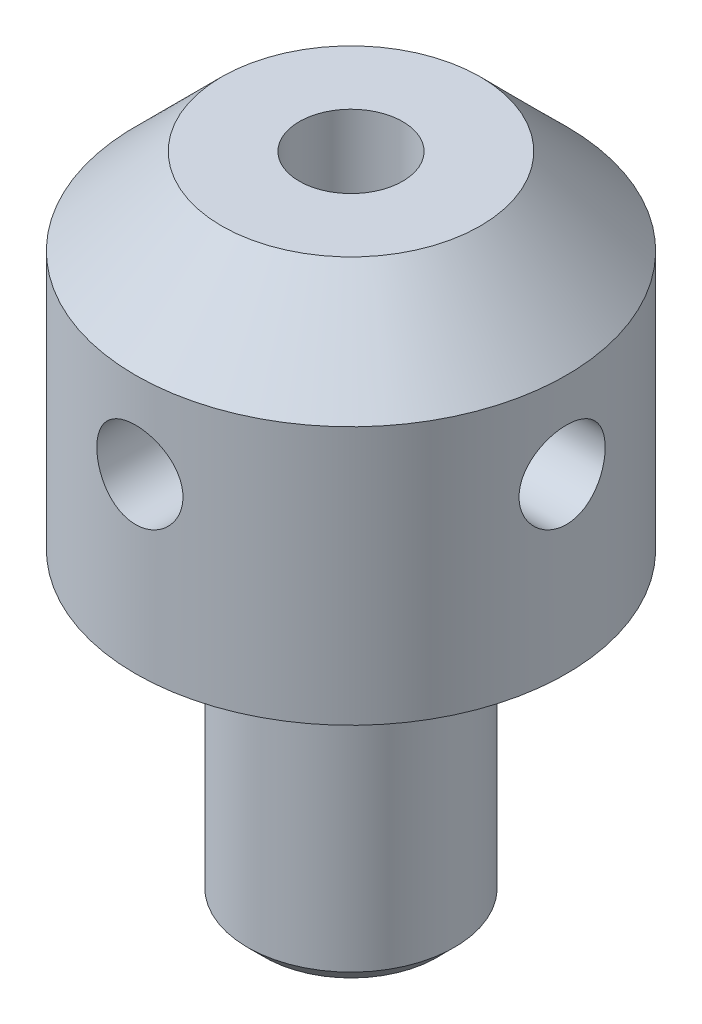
ISO-10303-21;
HEADER;
FILE_DESCRIPTION(('STEP AP214'),'2;1');
FILE_NAME('part.step','',(''),(''),'','','');
FILE_SCHEMA(('AUTOMOTIVE_DESIGN { 1 0 10303 214 1 1 1 1 }'));
ENDSEC;
DATA;
#1=APPLICATION_CONTEXT('core data for automotive mechanical design processes');
#2=APPLICATION_PROTOCOL_DEFINITION('international standard','automotive_design',2000,#1);
#3=PRODUCT_CONTEXT('',#1,'mechanical');
#4=PRODUCT('Part','Part','',(#3));
#5=PRODUCT_RELATED_PRODUCT_CATEGORY('part','',(#4));
#6=PRODUCT_DEFINITION_FORMATION('','',#4);
#7=PRODUCT_DEFINITION_CONTEXT('part definition',#1,'design');
#8=PRODUCT_DEFINITION('design','',#6,#7);
#9=PRODUCT_DEFINITION_SHAPE('','',#8);
#10=(LENGTH_UNIT() NAMED_UNIT(*) SI_UNIT(.MILLI.,.METRE.));
#11=(NAMED_UNIT(*) PLANE_ANGLE_UNIT() SI_UNIT($,.RADIAN.));
#12=(NAMED_UNIT(*) SI_UNIT($,.STERADIAN.) SOLID_ANGLE_UNIT());
#13=UNCERTAINTY_MEASURE_WITH_UNIT(LENGTH_MEASURE(1.E-05),#10,'distance_accuracy_value','');
#14=(GEOMETRIC_REPRESENTATION_CONTEXT(3) GLOBAL_UNCERTAINTY_ASSIGNED_CONTEXT((#13)) GLOBAL_UNIT_ASSIGNED_CONTEXT((#10,
#11,#12)) REPRESENTATION_CONTEXT('',''));
#15=CARTESIAN_POINT('',(0.,0.,0.));
#16=DIRECTION('',(0.,0.,1.));
#17=DIRECTION('',(1.,0.,0.));
#18=AXIS2_PLACEMENT_3D('',#15,#16,#17);
#19=CARTESIAN_POINT('',(0.,20.,0.));
#20=DIRECTION('',(0.,-1.,0.));
#21=DIRECTION('',(0.,0.,-1.));
#22=AXIS2_PLACEMENT_3D('',#19,#20,#21);
#23=CYLINDRICAL_SURFACE('',#22,12.5);
#24=CARTESIAN_POINT('',(0.,12.5,-12.5));
#25=CARTESIAN_POINT('',(0.138942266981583,12.4999948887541,-12.4999974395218));
#26=CARTESIAN_POINT('',(0.277949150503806,12.4883778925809,-12.4976596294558));
#27=CARTESIAN_POINT('',(0.552033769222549,12.4422537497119,-12.4885591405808));
#28=CARTESIAN_POINT('',(0.687108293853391,12.4077284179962,-12.4817929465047));
#29=CARTESIAN_POINT('',(0.949325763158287,12.3168968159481,-12.4645912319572));
#30=CARTESIAN_POINT('',(1.07647616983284,12.2606114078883,-12.454159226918));
#31=CARTESIAN_POINT('',(1.31951997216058,12.1279193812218,-12.4307599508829));
#32=CARTESIAN_POINT('',(1.43541403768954,12.051513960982,-12.4177928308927));
#33=CARTESIAN_POINT('',(1.65423369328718,11.8796537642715,-12.3905541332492));
#34=CARTESIAN_POINT('',(1.75698487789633,11.7839791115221,-12.3762686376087));
#35=CARTESIAN_POINT('',(1.9450918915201,11.5767689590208,-12.3481045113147));
#36=CARTESIAN_POINT('',(2.03044636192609,11.4652322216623,-12.3342259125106));
#37=CARTESIAN_POINT('',(2.18207938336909,11.2282095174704,-12.3083110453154));
#38=CARTESIAN_POINT('',(2.24817734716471,11.1026058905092,-12.2962926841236));
#39=CARTESIAN_POINT('',(2.35826416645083,10.8417954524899,-12.2756567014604));
#40=CARTESIAN_POINT('',(2.40225520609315,10.7065895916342,-12.267038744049));
#41=CARTESIAN_POINT('',(2.46631324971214,10.4322890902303,-12.2543201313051));
#42=CARTESIAN_POINT('',(2.48668624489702,10.2932686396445,-12.2501617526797));
#43=CARTESIAN_POINT('',(2.50388031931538,10.0137254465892,-12.2466593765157));
#44=CARTESIAN_POINT('',(2.50070380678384,9.87320285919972,-12.247314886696));
#45=CARTESIAN_POINT('',(2.47113643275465,9.59688302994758,-12.2533137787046));
#46=CARTESIAN_POINT('',(2.44509635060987,9.4610464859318,-12.2585863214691));
#47=CARTESIAN_POINT('',(2.37109471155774,9.19570980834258,-12.273113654));
#48=CARTESIAN_POINT('',(2.32313210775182,9.06620997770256,-12.2823686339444));
#49=CARTESIAN_POINT('',(2.20631195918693,8.81621184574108,-12.3038904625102));
#50=CARTESIAN_POINT('',(2.13731537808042,8.69578030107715,-12.3161772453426));
#51=CARTESIAN_POINT('',(1.98048393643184,8.46807287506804,-12.3423654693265));
#52=CARTESIAN_POINT('',(1.89264691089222,8.36079850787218,-12.3562670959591));
#53=CARTESIAN_POINT('',(1.69874983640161,8.16042649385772,-12.3844255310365));
#54=CARTESIAN_POINT('',(1.59239040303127,8.06761858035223,-12.3986842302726));
#55=CARTESIAN_POINT('',(1.36546256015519,7.90111538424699,-12.4257212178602));
#56=CARTESIAN_POINT('',(1.24489396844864,7.8274203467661,-12.4384994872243));
#57=CARTESIAN_POINT('',(0.992648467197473,7.7011812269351,-12.4611672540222));
#58=CARTESIAN_POINT('',(0.860954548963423,7.64867026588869,-12.4710522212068));
#59=CARTESIAN_POINT('',(0.590372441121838,7.56659881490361,-12.4867852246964));
#60=CARTESIAN_POINT('',(0.451485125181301,7.53703554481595,-12.4926337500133));
#61=CARTESIAN_POINT('',(0.172948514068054,7.50210886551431,-12.4995667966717));
#62=CARTESIAN_POINT('',(0.0333508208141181,7.49634895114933,-12.5007293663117));
#63=CARTESIAN_POINT('',(-0.244812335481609,7.50812464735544,-12.4983762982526));
#64=CARTESIAN_POINT('',(-0.383377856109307,7.52565894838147,-12.4948609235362));
#65=CARTESIAN_POINT('',(-0.654264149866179,7.58319593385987,-12.4835958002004));
#66=CARTESIAN_POINT('',(-0.786629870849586,7.62299517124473,-12.4758844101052));
#67=CARTESIAN_POINT('',(-1.042809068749,7.72370995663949,-12.4570888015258));
#68=CARTESIAN_POINT('',(-1.16662190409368,7.78462708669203,-12.4460043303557));
#69=CARTESIAN_POINT('',(-1.40385293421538,7.92670622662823,-12.4214977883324));
#70=CARTESIAN_POINT('',(-1.51712531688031,8.00810695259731,-12.4080487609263));
#71=CARTESIAN_POINT('',(-1.72854504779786,8.18852297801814,-12.3803683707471));
#72=CARTESIAN_POINT('',(-1.82669077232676,8.2875401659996,-12.3661369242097));
#73=CARTESIAN_POINT('',(-2.0066014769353,8.50218337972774,-12.3382325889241));
#74=CARTESIAN_POINT('',(-2.0880942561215,8.61803936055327,-12.3245715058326));
#75=CARTESIAN_POINT('',(-2.23046355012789,8.86202840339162,-12.2996047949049));
#76=CARTESIAN_POINT('',(-2.29134088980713,8.9901609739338,-12.2882990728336));
#77=CARTESIAN_POINT('',(-2.39037960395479,9.25442061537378,-12.2694185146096));
#78=CARTESIAN_POINT('',(-2.42865874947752,9.39050210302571,-12.2618243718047));
#79=CARTESIAN_POINT('',(-2.48177162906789,9.66733363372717,-12.2511859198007));
#80=CARTESIAN_POINT('',(-2.49660842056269,9.80808306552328,-12.2481410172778));
#81=CARTESIAN_POINT('',(-2.50230227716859,10.0875221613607,-12.2469787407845));
#82=CARTESIAN_POINT('',(-2.49358947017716,10.2262028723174,-12.2487729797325));
#83=CARTESIAN_POINT('',(-2.45338076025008,10.5000791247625,-12.2568893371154));
#84=CARTESIAN_POINT('',(-2.42188504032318,10.6352746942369,-12.2632114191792));
#85=CARTESIAN_POINT('',(-2.33719642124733,10.8980692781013,-12.279631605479));
#86=CARTESIAN_POINT('',(-2.28405626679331,11.025685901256,-12.2897205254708));
#87=CARTESIAN_POINT('',(-2.15763661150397,11.270259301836,-12.3125428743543));
#88=CARTESIAN_POINT('',(-2.08435542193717,11.3872151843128,-12.3252765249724));
#89=CARTESIAN_POINT('',(-1.91826478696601,11.6092889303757,-12.3522240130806));
#90=CARTESIAN_POINT('',(-1.82514471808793,11.7141719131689,-12.3664593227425));
#91=CARTESIAN_POINT('',(-1.62266092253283,11.9069655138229,-12.3946520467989));
#92=CARTESIAN_POINT('',(-1.51329346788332,11.9948722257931,-12.4086093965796));
#93=CARTESIAN_POINT('',(-1.28004407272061,12.1520866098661,-12.4348458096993));
#94=CARTESIAN_POINT('',(-1.15602221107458,12.2211900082,-12.4471057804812));
#95=CARTESIAN_POINT('',(-0.897915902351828,12.3374653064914,-12.468378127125));
#96=CARTESIAN_POINT('',(-0.763840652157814,12.3846569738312,-12.4773934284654));
#97=CARTESIAN_POINT('',(-0.524553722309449,12.4466298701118,-12.4894093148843));
#98=CARTESIAN_POINT('',(-0.420704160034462,12.4666079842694,-12.4933575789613));
#99=CARTESIAN_POINT('',(-0.211248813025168,12.4932947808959,-12.4986538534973));
#100=CARTESIAN_POINT('',(-0.105643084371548,12.5000038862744,-12.5000019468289));
#101=CARTESIAN_POINT('',(0.,12.5,-12.5));
#102=B_SPLINE_CURVE_WITH_KNOTS('',3,(#24,#25,#26,#27,#28,#29,#30,#31,#32,#33,#34,#35,#36,#37,
#38,#39,#40,#41,#42,#43,#44,#45,#46,#47,#48,#49,#50,#51,#52,#53,#54,#55,#56,#57,#58,#59,#60,#61,
#62,#63,#64,#65,#66,#67,#68,#69,#70,#71,#72,#73,#74,#75,#76,#77,#78,#79,#80,#81,#82,#83,#84,#85,
#86,#87,#88,#89,#90,#91,#92,#93,#94,#95,#96,#97,#98,#99,#100,#101),.UNSPECIFIED.,.T.,.F.,(4,2,2,
2,2,2,2,2,2,2,2,2,2,2,2,2,2,2,2,2,2,2,2,2,2,2,2,2,2,2,2,2,2,2,2,2,2,2,4),(0.,0.416440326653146,
0.833211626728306,1.24958433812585,1.66593225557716,2.08733167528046,2.50876399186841,
2.93402987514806,3.35925373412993,3.77890462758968,4.19851260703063,4.61179317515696,
5.02509348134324,5.44118725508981,5.85732886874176,6.28095631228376,6.7045891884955,
7.12888187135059,7.5531231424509,7.97026839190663,8.38739019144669,8.80076134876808,
9.21416348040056,9.63262665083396,10.0511347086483,10.4760157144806,10.9008797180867,
11.3235095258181,11.7460842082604,12.1609930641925,12.5758985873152,12.9897990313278,
13.4037341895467,13.8247019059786,14.2457663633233,14.6712374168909,15.096323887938,
15.4129693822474,15.7296047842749),.UNSPECIFIED.);
#103=CARTESIAN_POINT('',(0.,12.5,-12.5));
#104=VERTEX_POINT('',#103);
#105=EDGE_CURVE('E44',#104,#104,#102,.T.);
#106=ORIENTED_EDGE('',*,*,#105,.F.);
#107=EDGE_LOOP('',(#106));
#108=FACE_BOUND('',#107,.T.);
#109=CARTESIAN_POINT('',(0.,7.5,12.5));
#110=CARTESIAN_POINT('',(0.138942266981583,7.50000511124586,12.4999974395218));
#111=CARTESIAN_POINT('',(0.277949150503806,7.51162210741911,12.4976596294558));
#112=CARTESIAN_POINT('',(0.552033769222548,7.55774625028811,12.4885591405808));
#113=CARTESIAN_POINT('',(0.68710829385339,7.59227158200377,12.4817929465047));
#114=CARTESIAN_POINT('',(0.949325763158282,7.68310318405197,12.4645912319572));
#115=CARTESIAN_POINT('',(1.07647616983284,7.73938859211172,12.454159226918));
#116=CARTESIAN_POINT('',(1.31951997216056,7.87208061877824,12.4307599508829));
#117=CARTESIAN_POINT('',(1.43541403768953,7.94848603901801,12.4177928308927));
#118=CARTESIAN_POINT('',(1.65423369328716,8.12034623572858,12.3905541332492));
#119=CARTESIAN_POINT('',(1.75698487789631,8.21602088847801,12.3762686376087));
#120=CARTESIAN_POINT('',(1.94509189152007,8.42323104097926,12.3481045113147));
#121=CARTESIAN_POINT('',(2.03044636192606,8.5347677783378,12.3342259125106));
#122=CARTESIAN_POINT('',(2.18207938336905,8.77179048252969,12.3083110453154));
#123=CARTESIAN_POINT('',(2.24817734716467,8.8973941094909,12.2962926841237));
#124=CARTESIAN_POINT('',(2.35826416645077,9.1582045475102,12.2756567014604));
#125=CARTESIAN_POINT('',(2.40225520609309,9.29341040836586,12.267038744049));
#126=CARTESIAN_POINT('',(2.46631324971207,9.56771090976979,12.2543201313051));
#127=CARTESIAN_POINT('',(2.48668624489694,9.70673136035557,12.2501617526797));
#128=CARTESIAN_POINT('',(2.5038803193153,9.98627455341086,12.2466593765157));
#129=CARTESIAN_POINT('',(2.50070380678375,10.1267971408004,12.247314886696));
#130=CARTESIAN_POINT('',(2.47113643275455,10.4031169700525,12.2533137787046));
#131=CARTESIAN_POINT('',(2.44509635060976,10.5389535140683,12.2585863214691));
#132=CARTESIAN_POINT('',(2.37109471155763,10.8042901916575,12.273113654));
#133=CARTESIAN_POINT('',(2.3231321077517,10.9337900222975,12.2823686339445));
#134=CARTESIAN_POINT('',(2.2063119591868,11.183788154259,12.3038904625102));
#135=CARTESIAN_POINT('',(2.13731537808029,11.3042196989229,12.3161772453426));
#136=CARTESIAN_POINT('',(1.9804839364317,11.531927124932,12.3423654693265));
#137=CARTESIAN_POINT('',(1.89264691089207,11.6392014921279,12.3562670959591));
#138=CARTESIAN_POINT('',(1.69874983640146,11.8395735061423,12.3844255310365));
#139=CARTESIAN_POINT('',(1.59239040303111,11.9323814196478,12.3986842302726));
#140=CARTESIAN_POINT('',(1.36546256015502,12.0988846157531,12.4257212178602));
#141=CARTESIAN_POINT('',(1.24489396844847,12.1725796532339,12.4384994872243));
#142=CARTESIAN_POINT('',(0.992648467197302,12.2988187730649,12.4611672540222));
#143=CARTESIAN_POINT('',(0.86095454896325,12.3513297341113,12.4710522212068));
#144=CARTESIAN_POINT('',(0.590372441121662,12.4334011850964,12.4867852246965));
#145=CARTESIAN_POINT('',(0.451485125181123,12.4629644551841,12.4926337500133));
#146=CARTESIAN_POINT('',(0.172948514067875,12.4978911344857,12.4995667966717));
#147=CARTESIAN_POINT('',(0.0333508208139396,12.5036510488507,12.5007293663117));
#148=CARTESIAN_POINT('',(-0.244812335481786,12.4918753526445,12.4983762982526));
#149=CARTESIAN_POINT('',(-0.383377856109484,12.4743410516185,12.4948609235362));
#150=CARTESIAN_POINT('',(-0.654264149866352,12.4168040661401,12.4835958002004));
#151=CARTESIAN_POINT('',(-0.786629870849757,12.3770048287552,12.4758844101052));
#152=CARTESIAN_POINT('',(-1.04280906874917,12.2762900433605,12.4570888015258));
#153=CARTESIAN_POINT('',(-1.16662190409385,12.2153729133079,12.4460043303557));
#154=CARTESIAN_POINT('',(-1.40385293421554,12.0732937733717,12.4214977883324));
#155=CARTESIAN_POINT('',(-1.51712531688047,11.9918930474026,12.4080487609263));
#156=CARTESIAN_POINT('',(-1.72854504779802,11.8114770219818,12.3803683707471));
#157=CARTESIAN_POINT('',(-1.82669077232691,11.7124598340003,12.3661369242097));
#158=CARTESIAN_POINT('',(-2.00660147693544,11.4978166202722,12.3382325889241));
#159=CARTESIAN_POINT('',(-2.08809425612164,11.3819606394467,12.3245715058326));
#160=CARTESIAN_POINT('',(-2.23046355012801,11.1379715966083,12.2996047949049));
#161=CARTESIAN_POINT('',(-2.29134088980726,11.0098390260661,12.2882990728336));
#162=CARTESIAN_POINT('',(-2.3903796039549,10.7455793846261,12.2694185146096));
#163=CARTESIAN_POINT('',(-2.42865874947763,10.6094978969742,12.2618243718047));
#164=CARTESIAN_POINT('',(-2.48177162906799,10.3326663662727,12.2511859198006));
#165=CARTESIAN_POINT('',(-2.49660842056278,10.1919169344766,12.2481410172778));
#166=CARTESIAN_POINT('',(-2.50230227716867,9.91247783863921,12.2469787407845));
#167=CARTESIAN_POINT('',(-2.49358947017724,9.77379712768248,12.2487729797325));
#168=CARTESIAN_POINT('',(-2.45338076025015,9.49992087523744,12.2568893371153));
#169=CARTESIAN_POINT('',(-2.42188504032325,9.36472530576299,12.2632114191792));
#170=CARTESIAN_POINT('',(-2.33719642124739,9.10193072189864,12.279631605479));
#171=CARTESIAN_POINT('',(-2.28405626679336,8.97431409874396,12.2897205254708));
#172=CARTESIAN_POINT('',(-2.15763661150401,8.7297406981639,12.3125428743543));
#173=CARTESIAN_POINT('',(-2.08435542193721,8.61278481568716,12.3252765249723));
#174=CARTESIAN_POINT('',(-1.91826478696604,8.39071106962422,12.3522240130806));
#175=CARTESIAN_POINT('',(-1.82514471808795,8.28582808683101,12.3664593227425));
#176=CARTESIAN_POINT('',(-1.62266092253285,8.09303448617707,12.3946520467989));
#177=CARTESIAN_POINT('',(-1.51329346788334,8.00512777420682,12.4086093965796));
#178=CARTESIAN_POINT('',(-1.28004407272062,7.84791339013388,12.4348458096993));
#179=CARTESIAN_POINT('',(-1.15602221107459,7.77880999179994,12.4471057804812));
#180=CARTESIAN_POINT('',(-0.897915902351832,7.66253469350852,12.468378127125));
#181=CARTESIAN_POINT('',(-0.763840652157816,7.61534302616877,12.4773934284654));
#182=CARTESIAN_POINT('',(-0.524553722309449,7.55337012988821,12.4894093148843));
#183=CARTESIAN_POINT('',(-0.420704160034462,7.53339201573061,12.4933575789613));
#184=CARTESIAN_POINT('',(-0.211248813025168,7.50670521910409,12.4986538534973));
#185=CARTESIAN_POINT('',(-0.105643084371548,7.49999611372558,12.5000019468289));
#186=CARTESIAN_POINT('',(0.,7.5,12.5));
#187=B_SPLINE_CURVE_WITH_KNOTS('',3,(#109,#110,#111,#112,#113,#114,#115,#116,#117,#118,#119,
#120,#121,#122,#123,#124,#125,#126,#127,#128,#129,#130,#131,#132,#133,#134,#135,#136,#137,#138,
#139,#140,#141,#142,#143,#144,#145,#146,#147,#148,#149,#150,#151,#152,#153,#154,#155,#156,#157,
#158,#159,#160,#161,#162,#163,#164,#165,#166,#167,#168,#169,#170,#171,#172,#173,#174,#175,#176,
#177,#178,#179,#180,#181,#182,#183,#184,#185,#186),.UNSPECIFIED.,.T.,.F.,(4,2,2,2,2,2,2,2,2,2,2,
2,2,2,2,2,2,2,2,2,2,2,2,2,2,2,2,2,2,2,2,2,2,2,2,2,2,2,4),(0.,0.416440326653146,
0.833211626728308,1.24958433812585,1.66593225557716,2.08733167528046,2.50876399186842,
2.93402987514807,3.35925373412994,3.77890462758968,4.19851260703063,4.61179317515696,
5.02509348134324,5.44118725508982,5.85732886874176,6.28095631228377,6.70458918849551,
7.1288818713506,7.5531231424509,7.97026839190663,8.38739019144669,8.80076134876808,
9.21416348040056,9.63262665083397,10.0511347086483,10.4760157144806,10.9008797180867,
11.3235095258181,11.7460842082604,12.1609930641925,12.5758985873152,12.9897990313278,
13.4037341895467,13.8247019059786,14.2457663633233,14.6712374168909,15.096323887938,
15.4129693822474,15.7296047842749),.UNSPECIFIED.);
#188=CARTESIAN_POINT('',(0.,7.5,12.5));
#189=VERTEX_POINT('',#188);
#190=EDGE_CURVE('E52',#189,#189,#187,.T.);
#191=ORIENTED_EDGE('',*,*,#190,.F.);
#192=EDGE_LOOP('',(#191));
#193=FACE_BOUND('',#192,.T.);
#194=CARTESIAN_POINT('',(0.,15.,0.));
#195=DIRECTION('',(0.,1.,0.));
#196=DIRECTION('',(0.,0.,1.));
#197=AXIS2_PLACEMENT_3D('',#194,#195,#196);
#198=CIRCLE('',#197,12.5);
#199=CARTESIAN_POINT('',(0.,15.,12.5));
#200=VERTEX_POINT('',#199);
#201=EDGE_CURVE('E91',#200,#200,#198,.F.);
#202=ORIENTED_EDGE('',*,*,#201,.T.);
#203=EDGE_LOOP('',(#202));
#204=FACE_BOUND('',#203,.T.);
#205=CARTESIAN_POINT('',(0.,0.,0.));
#206=DIRECTION('',(0.,1.,0.));
#207=DIRECTION('',(0.,0.,1.));
#208=AXIS2_PLACEMENT_3D('',#205,#206,#207);
#209=CIRCLE('',#208,12.5);
#210=CARTESIAN_POINT('',(0.,0.,12.5));
#211=VERTEX_POINT('',#210);
#212=EDGE_CURVE('E106',#211,#211,#209,.T.);
#213=ORIENTED_EDGE('',*,*,#212,.T.);
#214=EDGE_LOOP('',(#213));
#215=FACE_BOUND('',#214,.T.);
#216=CARTESIAN_POINT('',(-12.5,7.5,0.));
#217=CARTESIAN_POINT('',(-12.4999974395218,7.50000511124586,0.138942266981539));
#218=CARTESIAN_POINT('',(-12.4976596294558,7.51162210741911,0.277949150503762));
#219=CARTESIAN_POINT('',(-12.4885591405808,7.55774625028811,0.552033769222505));
#220=CARTESIAN_POINT('',(-12.4817929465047,7.59227158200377,0.687108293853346));
#221=CARTESIAN_POINT('',(-12.4645912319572,7.68310318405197,0.949325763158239));
#222=CARTESIAN_POINT('',(-12.454159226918,7.73938859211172,1.07647616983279));
#223=CARTESIAN_POINT('',(-12.4307599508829,7.87208061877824,1.31951997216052));
#224=CARTESIAN_POINT('',(-12.4177928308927,7.94848603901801,1.43541403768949));
#225=CARTESIAN_POINT('',(-12.3905541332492,8.12034623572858,1.65423369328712));
#226=CARTESIAN_POINT('',(-12.3762686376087,8.21602088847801,1.75698487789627));
#227=CARTESIAN_POINT('',(-12.3481045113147,8.42323104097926,1.94509189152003));
#228=CARTESIAN_POINT('',(-12.3342259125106,8.5347677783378,2.03044636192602));
#229=CARTESIAN_POINT('',(-12.3083110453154,8.77179048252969,2.18207938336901));
#230=CARTESIAN_POINT('',(-12.2962926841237,8.8973941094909,2.24817734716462));
#231=CARTESIAN_POINT('',(-12.2756567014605,9.1582045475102,2.35826416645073));
#232=CARTESIAN_POINT('',(-12.2670387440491,9.29341040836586,2.40225520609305));
#233=CARTESIAN_POINT('',(-12.2543201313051,9.56771090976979,2.46631324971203));
#234=CARTESIAN_POINT('',(-12.2501617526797,9.70673136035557,2.4866862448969));
#235=CARTESIAN_POINT('',(-12.2466593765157,9.98627455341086,2.50388031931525));
#236=CARTESIAN_POINT('',(-12.247314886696,10.1267971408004,2.50070380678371));
#237=CARTESIAN_POINT('',(-12.2533137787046,10.4031169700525,2.4711364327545));
#238=CARTESIAN_POINT('',(-12.2585863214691,10.5389535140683,2.44509635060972));
#239=CARTESIAN_POINT('',(-12.273113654,10.8042901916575,2.37109471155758));
#240=CARTESIAN_POINT('',(-12.2823686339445,10.9337900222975,2.32313210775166));
#241=CARTESIAN_POINT('',(-12.3038904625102,11.183788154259,2.20631195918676));
#242=CARTESIAN_POINT('',(-12.3161772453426,11.3042196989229,2.13731537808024));
#243=CARTESIAN_POINT('',(-12.3423654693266,11.531927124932,1.98048393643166));
#244=CARTESIAN_POINT('',(-12.3562670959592,11.6392014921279,1.89264691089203));
#245=CARTESIAN_POINT('',(-12.3844255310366,11.8395735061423,1.69874983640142));
#246=CARTESIAN_POINT('',(-12.3986842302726,11.9323814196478,1.59239040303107));
#247=CARTESIAN_POINT('',(-12.4257212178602,12.0988846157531,1.36546256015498));
#248=CARTESIAN_POINT('',(-12.4384994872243,12.1725796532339,1.24489396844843));
#249=CARTESIAN_POINT('',(-12.4611672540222,12.2988187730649,0.992648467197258));
#250=CARTESIAN_POINT('',(-12.4710522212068,12.3513297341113,0.860954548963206));
#251=CARTESIAN_POINT('',(-12.4867852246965,12.4334011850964,0.590372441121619));
#252=CARTESIAN_POINT('',(-12.4926337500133,12.4629644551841,0.45148512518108));
#253=CARTESIAN_POINT('',(-12.4995667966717,12.4978911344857,0.172948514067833));
#254=CARTESIAN_POINT('',(-12.5007293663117,12.5036510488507,0.0333508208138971));
#255=CARTESIAN_POINT('',(-12.4983762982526,12.4918753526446,-0.244812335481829));
#256=CARTESIAN_POINT('',(-12.4948609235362,12.4743410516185,-0.383377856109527));
#257=CARTESIAN_POINT('',(-12.4835958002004,12.4168040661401,-0.654264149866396));
#258=CARTESIAN_POINT('',(-12.4758844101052,12.3770048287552,-0.786629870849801));
#259=CARTESIAN_POINT('',(-12.4570888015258,12.2762900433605,-1.04280906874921));
#260=CARTESIAN_POINT('',(-12.4460043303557,12.2153729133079,-1.16662190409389));
#261=CARTESIAN_POINT('',(-12.4214977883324,12.0732937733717,-1.40385293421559));
#262=CARTESIAN_POINT('',(-12.4080487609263,11.9918930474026,-1.51712531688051));
#263=CARTESIAN_POINT('',(-12.3803683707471,11.8114770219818,-1.72854504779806));
#264=CARTESIAN_POINT('',(-12.3661369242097,11.7124598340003,-1.82669077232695));
#265=CARTESIAN_POINT('',(-12.3382325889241,11.4978166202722,-2.00660147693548));
#266=CARTESIAN_POINT('',(-12.3245715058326,11.3819606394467,-2.08809425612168));
#267=CARTESIAN_POINT('',(-12.2996047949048,11.1379715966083,-2.23046355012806));
#268=CARTESIAN_POINT('',(-12.2882990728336,11.0098390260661,-2.2913408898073));
#269=CARTESIAN_POINT('',(-12.2694185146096,10.7455793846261,-2.39037960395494));
#270=CARTESIAN_POINT('',(-12.2618243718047,10.6094978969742,-2.42865874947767));
#271=CARTESIAN_POINT('',(-12.2511859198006,10.3326663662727,-2.48177162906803));
#272=CARTESIAN_POINT('',(-12.2481410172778,10.1919169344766,-2.49660842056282));
#273=CARTESIAN_POINT('',(-12.2469787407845,9.91247783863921,-2.50230227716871));
#274=CARTESIAN_POINT('',(-12.2487729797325,9.77379712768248,-2.49358947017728));
#275=CARTESIAN_POINT('',(-12.2568893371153,9.49992087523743,-2.45338076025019));
#276=CARTESIAN_POINT('',(-12.2632114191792,9.36472530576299,-2.42188504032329));
#277=CARTESIAN_POINT('',(-12.279631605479,9.10193072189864,-2.33719642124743));
#278=CARTESIAN_POINT('',(-12.2897205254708,8.97431409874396,-2.28405626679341));
#279=CARTESIAN_POINT('',(-12.3125428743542,8.7297406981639,-2.15763661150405));
#280=CARTESIAN_POINT('',(-12.3252765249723,8.61278481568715,-2.08435542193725));
#281=CARTESIAN_POINT('',(-12.3522240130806,8.39071106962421,-1.91826478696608));
#282=CARTESIAN_POINT('',(-12.3664593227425,8.28582808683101,-1.82514471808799));
#283=CARTESIAN_POINT('',(-12.3946520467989,8.09303448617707,-1.6226609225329));
#284=CARTESIAN_POINT('',(-12.4086093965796,8.00512777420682,-1.51329346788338));
#285=CARTESIAN_POINT('',(-12.4348458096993,7.84791339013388,-1.28004407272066));
#286=CARTESIAN_POINT('',(-12.4471057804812,7.77880999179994,-1.15602221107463));
#287=CARTESIAN_POINT('',(-12.468378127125,7.66253469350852,-0.897915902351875));
#288=CARTESIAN_POINT('',(-12.4773934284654,7.61534302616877,-0.763840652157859));
#289=CARTESIAN_POINT('',(-12.4894093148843,7.55337012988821,-0.524553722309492));
#290=CARTESIAN_POINT('',(-12.4933575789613,7.53339201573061,-0.420704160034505));
#291=CARTESIAN_POINT('',(-12.4986538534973,7.50670521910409,-0.211248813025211));
#292=CARTESIAN_POINT('',(-12.5000019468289,7.49999611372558,-0.105643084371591));
#293=CARTESIAN_POINT('',(-12.5,7.5,0.));
#294=B_SPLINE_CURVE_WITH_KNOTS('',3,(#216,#217,#218,#219,#220,#221,#222,#223,#224,#225,#226,
#227,#228,#229,#230,#231,#232,#233,#234,#235,#236,#237,#238,#239,#240,#241,#242,#243,#244,#245,
#246,#247,#248,#249,#250,#251,#252,#253,#254,#255,#256,#257,#258,#259,#260,#261,#262,#263,#264,
#265,#266,#267,#268,#269,#270,#271,#272,#273,#274,#275,#276,#277,#278,#279,#280,#281,#282,#283,
#284,#285,#286,#287,#288,#289,#290,#291,#292,#293),.UNSPECIFIED.,.T.,.F.,(4,2,2,2,2,2,2,2,2,2,2,
2,2,2,2,2,2,2,2,2,2,2,2,2,2,2,2,2,2,2,2,2,2,2,2,2,2,2,4),(0.,0.416440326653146,
0.833211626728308,1.24958433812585,1.66593225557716,2.08733167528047,2.50876399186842,
2.93402987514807,3.35925373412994,3.77890462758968,4.19851260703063,4.61179317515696,
5.02509348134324,5.44118725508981,5.85732886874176,6.28095631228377,6.70458918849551,
7.1288818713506,7.5531231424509,7.97026839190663,8.38739019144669,8.80076134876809,
9.21416348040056,9.63262665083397,10.0511347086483,10.4760157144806,10.9008797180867,
11.3235095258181,11.7460842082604,12.1609930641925,12.5758985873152,12.9897990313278,
13.4037341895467,13.8247019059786,14.2457663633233,14.6712374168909,15.096323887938,
15.4129693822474,15.7296047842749),.UNSPECIFIED.);
#295=CARTESIAN_POINT('',(-12.5,7.5,0.));
#296=VERTEX_POINT('',#295);
#297=EDGE_CURVE('E48',#296,#296,#294,.T.);
#298=ORIENTED_EDGE('',*,*,#297,.F.);
#299=EDGE_LOOP('',(#298));
#300=FACE_BOUND('',#299,.T.);
#301=CARTESIAN_POINT('',(12.5,7.5,1.30930626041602E-13));
#302=CARTESIAN_POINT('',(12.4999974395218,7.50000511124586,-0.138942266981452));
#303=CARTESIAN_POINT('',(12.4976596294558,7.51162210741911,-0.277949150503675));
#304=CARTESIAN_POINT('',(12.4885591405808,7.55774625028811,-0.552033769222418));
#305=CARTESIAN_POINT('',(12.4817929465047,7.59227158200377,-0.687108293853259));
#306=CARTESIAN_POINT('',(12.4645912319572,7.68310318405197,-0.949325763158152));
#307=CARTESIAN_POINT('',(12.454159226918,7.73938859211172,-1.07647616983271));
#308=CARTESIAN_POINT('',(12.4307599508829,7.87208061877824,-1.31951997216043));
#309=CARTESIAN_POINT('',(12.4177928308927,7.94848603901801,-1.4354140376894));
#310=CARTESIAN_POINT('',(12.3905541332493,8.12034623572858,-1.65423369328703));
#311=CARTESIAN_POINT('',(12.3762686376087,8.21602088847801,-1.75698487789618));
#312=CARTESIAN_POINT('',(12.3481045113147,8.42323104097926,-1.94509189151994));
#313=CARTESIAN_POINT('',(12.3342259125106,8.5347677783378,-2.03044636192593));
#314=CARTESIAN_POINT('',(12.3083110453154,8.77179048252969,-2.18207938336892));
#315=CARTESIAN_POINT('',(12.2962926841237,8.8973941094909,-2.24817734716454));
#316=CARTESIAN_POINT('',(12.2756567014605,9.1582045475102,-2.35826416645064));
#317=CARTESIAN_POINT('',(12.2670387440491,9.29341040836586,-2.40225520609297));
#318=CARTESIAN_POINT('',(12.2543201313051,9.56771090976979,-2.46631324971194));
#319=CARTESIAN_POINT('',(12.2501617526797,9.70673136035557,-2.48668624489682));
#320=CARTESIAN_POINT('',(12.2466593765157,9.98627455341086,-2.50388031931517));
#321=CARTESIAN_POINT('',(12.247314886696,10.1267971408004,-2.50070380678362));
#322=CARTESIAN_POINT('',(12.2533137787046,10.4031169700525,-2.47113643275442));
#323=CARTESIAN_POINT('',(12.2585863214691,10.5389535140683,-2.44509635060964));
#324=CARTESIAN_POINT('',(12.2731136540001,10.8042901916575,-2.3710947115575));
#325=CARTESIAN_POINT('',(12.2823686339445,10.9337900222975,-2.32313210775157));
#326=CARTESIAN_POINT('',(12.3038904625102,11.183788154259,-2.20631195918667));
#327=CARTESIAN_POINT('',(12.3161772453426,11.3042196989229,-2.13731537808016));
#328=CARTESIAN_POINT('',(12.3423654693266,11.531927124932,-1.98048393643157));
#329=CARTESIAN_POINT('',(12.3562670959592,11.6392014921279,-1.89264691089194));
#330=CARTESIAN_POINT('',(12.3844255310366,11.8395735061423,-1.69874983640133));
#331=CARTESIAN_POINT('',(12.3986842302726,11.9323814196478,-1.59239040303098));
#332=CARTESIAN_POINT('',(12.4257212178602,12.0988846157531,-1.36546256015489));
#333=CARTESIAN_POINT('',(12.4384994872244,12.1725796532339,-1.24489396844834));
#334=CARTESIAN_POINT('',(12.4611672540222,12.2988187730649,-0.992648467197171));
#335=CARTESIAN_POINT('',(12.4710522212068,12.3513297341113,-0.860954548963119));
#336=CARTESIAN_POINT('',(12.4867852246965,12.4334011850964,-0.590372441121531));
#337=CARTESIAN_POINT('',(12.4926337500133,12.4629644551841,-0.451485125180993));
#338=CARTESIAN_POINT('',(12.4995667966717,12.4978911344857,-0.172948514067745));
#339=CARTESIAN_POINT('',(12.5007293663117,12.5036510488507,-0.0333508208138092));
#340=CARTESIAN_POINT('',(12.4983762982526,12.4918753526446,0.244812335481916));
#341=CARTESIAN_POINT('',(12.4948609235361,12.4743410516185,0.383377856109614));
#342=CARTESIAN_POINT('',(12.4835958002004,12.4168040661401,0.654264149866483));
#343=CARTESIAN_POINT('',(12.4758844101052,12.3770048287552,0.786629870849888));
#344=CARTESIAN_POINT('',(12.4570888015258,12.2762900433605,1.0428090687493));
#345=CARTESIAN_POINT('',(12.4460043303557,12.2153729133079,1.16662190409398));
#346=CARTESIAN_POINT('',(12.4214977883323,12.0732937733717,1.40385293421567));
#347=CARTESIAN_POINT('',(12.4080487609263,11.9918930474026,1.5171253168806));
#348=CARTESIAN_POINT('',(12.380368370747,11.8114770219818,1.72854504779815));
#349=CARTESIAN_POINT('',(12.3661369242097,11.7124598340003,1.82669077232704));
#350=CARTESIAN_POINT('',(12.3382325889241,11.4978166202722,2.00660147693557));
#351=CARTESIAN_POINT('',(12.3245715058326,11.3819606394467,2.08809425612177));
#352=CARTESIAN_POINT('',(12.2996047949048,11.1379715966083,2.23046355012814));
#353=CARTESIAN_POINT('',(12.2882990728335,11.0098390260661,2.29134088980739));
#354=CARTESIAN_POINT('',(12.2694185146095,10.7455793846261,2.39037960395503));
#355=CARTESIAN_POINT('',(12.2618243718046,10.6094978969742,2.42865874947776));
#356=CARTESIAN_POINT('',(12.2511859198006,10.3326663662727,2.48177162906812));
#357=CARTESIAN_POINT('',(12.2481410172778,10.1919169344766,2.49660842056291));
#358=CARTESIAN_POINT('',(12.2469787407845,9.91247783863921,2.5023022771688));
#359=CARTESIAN_POINT('',(12.2487729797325,9.77379712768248,2.49358947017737));
#360=CARTESIAN_POINT('',(12.2568893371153,9.49992087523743,2.45338076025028));
#361=CARTESIAN_POINT('',(12.2632114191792,9.36472530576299,2.42188504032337));
#362=CARTESIAN_POINT('',(12.2796316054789,9.10193072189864,2.33719642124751));
#363=CARTESIAN_POINT('',(12.2897205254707,8.97431409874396,2.28405626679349));
#364=CARTESIAN_POINT('',(12.3125428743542,8.7297406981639,2.15763661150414));
#365=CARTESIAN_POINT('',(12.3252765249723,8.61278481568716,2.08435542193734));
#366=CARTESIAN_POINT('',(12.3522240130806,8.39071106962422,1.91826478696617));
#367=CARTESIAN_POINT('',(12.3664593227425,8.28582808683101,1.82514471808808));
#368=CARTESIAN_POINT('',(12.3946520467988,8.09303448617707,1.62266092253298));
#369=CARTESIAN_POINT('',(12.4086093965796,8.00512777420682,1.51329346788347));
#370=CARTESIAN_POINT('',(12.4348458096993,7.84791339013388,1.28004407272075));
#371=CARTESIAN_POINT('',(12.4471057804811,7.77880999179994,1.15602221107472));
#372=CARTESIAN_POINT('',(12.468378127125,7.66253469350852,0.897915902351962));
#373=CARTESIAN_POINT('',(12.4773934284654,7.61534302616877,0.763840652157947));
#374=CARTESIAN_POINT('',(12.4894093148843,7.55337012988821,0.52455372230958));
#375=CARTESIAN_POINT('',(12.4933575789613,7.53339201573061,0.420704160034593));
#376=CARTESIAN_POINT('',(12.4986538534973,7.50670521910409,0.211248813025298));
#377=CARTESIAN_POINT('',(12.5000019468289,7.49999611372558,0.105643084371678));
#378=CARTESIAN_POINT('',(12.5,7.5,1.30930626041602E-13));
#379=B_SPLINE_CURVE_WITH_KNOTS('',3,(#301,#302,#303,#304,#305,#306,#307,#308,#309,#310,#311,
#312,#313,#314,#315,#316,#317,#318,#319,#320,#321,#322,#323,#324,#325,#326,#327,#328,#329,#330,
#331,#332,#333,#334,#335,#336,#337,#338,#339,#340,#341,#342,#343,#344,#345,#346,#347,#348,#349,
#350,#351,#352,#353,#354,#355,#356,#357,#358,#359,#360,#361,#362,#363,#364,#365,#366,#367,#368,
#369,#370,#371,#372,#373,#374,#375,#376,#377,#378),.UNSPECIFIED.,.T.,.F.,(4,2,2,2,2,2,2,2,2,2,2,
2,2,2,2,2,2,2,2,2,2,2,2,2,2,2,2,2,2,2,2,2,2,2,2,2,2,2,4),(0.,0.416440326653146,
0.833211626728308,1.24958433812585,1.66593225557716,2.08733167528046,2.50876399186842,
2.93402987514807,3.35925373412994,3.77890462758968,4.19851260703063,4.61179317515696,
5.02509348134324,5.44118725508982,5.85732886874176,6.28095631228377,6.70458918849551,
7.1288818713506,7.5531231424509,7.97026839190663,8.38739019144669,8.80076134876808,
9.21416348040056,9.63262665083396,10.0511347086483,10.4760157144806,10.9008797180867,
11.3235095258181,11.7460842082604,12.1609930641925,12.5758985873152,12.9897990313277,
13.4037341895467,13.8247019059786,14.2457663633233,14.6712374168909,15.096323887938,
15.4129693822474,15.7296047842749),.UNSPECIFIED.);
#380=CARTESIAN_POINT('',(12.5,7.5,1.30930626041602E-13));
#381=VERTEX_POINT('',#380);
#382=EDGE_CURVE('E11',#381,#381,#379,.T.);
#383=ORIENTED_EDGE('',*,*,#382,.F.);
#384=EDGE_LOOP('',(#383));
#385=FACE_BOUND('',#384,.T.);
#386=ADVANCED_FACE('F34',(#108,#193,#204,#215,#300,#385),#23,.T.);
#387=CARTESIAN_POINT('',(0.,0.,0.));
#388=DIRECTION('',(0.,1.,0.));
#389=DIRECTION('',(0.,0.,1.));
#390=AXIS2_PLACEMENT_3D('',#387,#388,#389);
#391=PLANE('',#390);
#392=ORIENTED_EDGE('',*,*,#212,.F.);
#393=EDGE_LOOP('',(#392));
#394=FACE_BOUND('',#393,.T.);
#395=CARTESIAN_POINT('',(0.,0.,0.));
#396=DIRECTION('',(0.,1.,0.));
#397=DIRECTION('',(0.,0.,1.));
#398=AXIS2_PLACEMENT_3D('',#395,#396,#397);
#399=CIRCLE('',#398,6.);
#400=CARTESIAN_POINT('',(0.,0.,6.));
#401=VERTEX_POINT('',#400);
#402=EDGE_CURVE('E103',#401,#401,#399,.F.);
#403=ORIENTED_EDGE('',*,*,#402,.F.);
#404=EDGE_LOOP('',(#403));
#405=FACE_BOUND('',#404,.T.);
#406=ADVANCED_FACE('F140',(#394,#405),#391,.F.);
#407=CARTESIAN_POINT('',(0.,20.,0.));
#408=DIRECTION('',(0.,1.,0.));
#409=DIRECTION('',(0.,0.,1.));
#410=AXIS2_PLACEMENT_3D('',#407,#408,#409);
#411=PLANE('',#410);
#412=CARTESIAN_POINT('',(0.,20.,0.));
#413=DIRECTION('',(0.,1.,0.));
#414=DIRECTION('',(0.,0.,1.));
#415=AXIS2_PLACEMENT_3D('',#412,#413,#414);
#416=CIRCLE('',#415,3.);
#417=CARTESIAN_POINT('',(0.,20.,3.));
#418=VERTEX_POINT('',#417);
#419=EDGE_CURVE('E112',#418,#418,#416,.T.);
#420=ORIENTED_EDGE('',*,*,#419,.F.);
#421=EDGE_LOOP('',(#420));
#422=FACE_BOUND('',#421,.T.);
#423=CARTESIAN_POINT('',(0.,20.,0.));
#424=DIRECTION('',(0.,1.,0.));
#425=DIRECTION('',(0.,0.,1.));
#426=AXIS2_PLACEMENT_3D('',#423,#424,#425);
#427=CIRCLE('',#426,7.49999999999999);
#428=CARTESIAN_POINT('',(0.,20.,7.49999999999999));
#429=VERTEX_POINT('',#428);
#430=EDGE_CURVE('E94',#429,#429,#427,.T.);
#431=ORIENTED_EDGE('',*,*,#430,.T.);
#432=EDGE_LOOP('',(#431));
#433=FACE_BOUND('',#432,.T.);
#434=ADVANCED_FACE('F145',(#422,#433),#411,.T.);
#435=CARTESIAN_POINT('',(0.,-18.,0.));
#436=DIRECTION('',(0.,1.,0.));
#437=DIRECTION('',(0.,0.,1.));
#438=AXIS2_PLACEMENT_3D('',#435,#436,#437);
#439=CYLINDRICAL_SURFACE('',#438,6.);
#440=CARTESIAN_POINT('',(0.,-17.,0.));
#441=DIRECTION('',(0.,-1.,0.));
#442=DIRECTION('',(0.,0.,-1.));
#443=AXIS2_PLACEMENT_3D('',#440,#441,#442);
#444=CIRCLE('',#443,6.);
#445=CARTESIAN_POINT('',(0.,-17.,-6.));
#446=VERTEX_POINT('',#445);
#447=EDGE_CURVE('E97',#446,#446,#444,.F.);
#448=ORIENTED_EDGE('',*,*,#447,.T.);
#449=EDGE_LOOP('',(#448));
#450=FACE_BOUND('',#449,.T.);
#451=ORIENTED_EDGE('',*,*,#402,.T.);
#452=EDGE_LOOP('',(#451));
#453=FACE_BOUND('',#452,.T.);
#454=ADVANCED_FACE('F161',(#450,#453),#439,.T.);
#455=CARTESIAN_POINT('',(0.,-18.,0.));
#456=DIRECTION('',(0.,-1.,0.));
#457=DIRECTION('',(0.,0.,-1.));
#458=AXIS2_PLACEMENT_3D('',#455,#456,#457);
#459=PLANE('',#458);
#460=CARTESIAN_POINT('',(0.,-18.,0.));
#461=DIRECTION('',(0.,1.,0.));
#462=DIRECTION('',(0.,0.,1.));
#463=AXIS2_PLACEMENT_3D('',#460,#461,#462);
#464=CIRCLE('',#463,3.);
#465=CARTESIAN_POINT('',(0.,-18.,3.));
#466=VERTEX_POINT('',#465);
#467=EDGE_CURVE('E109',#466,#466,#464,.T.);
#468=ORIENTED_EDGE('',*,*,#467,.T.);
#469=EDGE_LOOP('',(#468));
#470=FACE_BOUND('',#469,.T.);
#471=CARTESIAN_POINT('',(0.,-18.,0.));
#472=DIRECTION('',(0.,-1.,0.));
#473=DIRECTION('',(0.,0.,-1.));
#474=AXIS2_PLACEMENT_3D('',#471,#472,#473);
#475=CIRCLE('',#474,5.);
#476=CARTESIAN_POINT('',(0.,-18.,-5.));
#477=VERTEX_POINT('',#476);
#478=EDGE_CURVE('E100',#477,#477,#475,.T.);
#479=ORIENTED_EDGE('',*,*,#478,.T.);
#480=EDGE_LOOP('',(#479));
#481=FACE_BOUND('',#480,.T.);
#482=ADVANCED_FACE('F163',(#470,#481),#459,.T.);
#483=CARTESIAN_POINT('',(0.,-18.,0.));
#484=DIRECTION('',(0.,1.,0.));
#485=DIRECTION('',(0.,0.,1.));
#486=AXIS2_PLACEMENT_3D('',#483,#484,#485);
#487=CONICAL_SURFACE('',#486,5.,0.78539816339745);
#488=ORIENTED_EDGE('',*,*,#447,.F.);
#489=EDGE_LOOP('',(#488));
#490=FACE_BOUND('',#489,.T.);
#491=ORIENTED_EDGE('',*,*,#478,.F.);
#492=EDGE_LOOP('',(#491));
#493=FACE_BOUND('',#492,.T.);
#494=ADVANCED_FACE('F170',(#490,#493),#487,.T.);
#495=CARTESIAN_POINT('',(0.,20.,0.));
#496=DIRECTION('',(0.,-1.,0.));
#497=DIRECTION('',(0.,0.,-1.));
#498=AXIS2_PLACEMENT_3D('',#495,#496,#497);
#499=CONICAL_SURFACE('',#498,7.49999999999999,0.785398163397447);
#500=ORIENTED_EDGE('',*,*,#201,.F.);
#501=EDGE_LOOP('',(#500));
#502=FACE_BOUND('',#501,.T.);
#503=ORIENTED_EDGE('',*,*,#430,.F.);
#504=EDGE_LOOP('',(#503));
#505=FACE_BOUND('',#504,.T.);
#506=ADVANCED_FACE('F176',(#502,#505),#499,.T.);
#507=CARTESIAN_POINT('',(0.,-18.,0.));
#508=DIRECTION('',(0.,1.,0.));
#509=DIRECTION('',(0.,0.,1.));
#510=AXIS2_PLACEMENT_3D('',#507,#508,#509);
#511=CYLINDRICAL_SURFACE('',#510,3.);
#512=ORIENTED_EDGE('',*,*,#467,.F.);
#513=EDGE_LOOP('',(#512));
#514=FACE_BOUND('',#513,.T.);
#515=ORIENTED_EDGE('',*,*,#419,.T.);
#516=EDGE_LOOP('',(#515));
#517=FACE_BOUND('',#516,.T.);
#518=ADVANCED_FACE('F84',(#514,#517),#511,.F.);
#519=CARTESIAN_POINT('',(0.,10.,12.5));
#520=DIRECTION('',(0.,0.,-1.));
#521=DIRECTION('',(-1.,0.,0.));
#522=AXIS2_PLACEMENT_3D('',#519,#520,#521);
#523=CYLINDRICAL_SURFACE('',#522,2.5);
#524=CARTESIAN_POINT('',(0.,10.,7.5));
#525=DIRECTION('',(0.,0.,1.));
#526=DIRECTION('',(1.,0.,0.));
#527=AXIS2_PLACEMENT_3D('',#524,#525,#526);
#528=CIRCLE('',#527,2.5);
#529=CARTESIAN_POINT('',(2.5,10.,7.5));
#530=VERTEX_POINT('',#529);
#531=EDGE_CURVE('E115',#530,#530,#528,.T.);
#532=ORIENTED_EDGE('',*,*,#531,.F.);
#533=EDGE_LOOP('',(#532));
#534=FACE_BOUND('',#533,.T.);
#535=ORIENTED_EDGE('',*,*,#190,.T.);
#536=EDGE_LOOP('',(#535));
#537=FACE_BOUND('',#536,.T.);
#538=ADVANCED_FACE('F79',(#534,#537),#523,.F.);
#539=CARTESIAN_POINT('',(-19.2835569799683,10.,7.5));
#540=DIRECTION('',(0.,0.,-1.));
#541=DIRECTION('',(-1.,0.,0.));
#542=AXIS2_PLACEMENT_3D('',#539,#540,#541);
#543=PLANE('',#542);
#544=ORIENTED_EDGE('',*,*,#531,.T.);
#545=EDGE_LOOP('',(#544));
#546=FACE_BOUND('',#545,.T.);
#547=ADVANCED_FACE('F75',(#546),#543,.F.);
#548=CARTESIAN_POINT('',(-12.5,10.,0.));
#549=DIRECTION('',(1.,0.,0.));
#550=DIRECTION('',(0.,0.,-1.));
#551=AXIS2_PLACEMENT_3D('',#548,#549,#550);
#552=CYLINDRICAL_SURFACE('',#551,2.5);
#553=CARTESIAN_POINT('',(-7.5,10.,0.));
#554=DIRECTION('',(-1.,0.,0.));
#555=DIRECTION('',(0.,0.,1.));
#556=AXIS2_PLACEMENT_3D('',#553,#554,#555);
#557=CIRCLE('',#556,2.5);
#558=CARTESIAN_POINT('',(-7.50000000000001,10.,2.49999999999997));
#559=VERTEX_POINT('',#558);
#560=EDGE_CURVE('E118',#559,#559,#557,.T.);
#561=ORIENTED_EDGE('',*,*,#560,.F.);
#562=EDGE_LOOP('',(#561));
#563=FACE_BOUND('',#562,.T.);
#564=ORIENTED_EDGE('',*,*,#297,.T.);
#565=EDGE_LOOP('',(#564));
#566=FACE_BOUND('',#565,.T.);
#567=ADVANCED_FACE('F70',(#563,#566),#552,.F.);
#568=CARTESIAN_POINT('',(-7.5,-9.28355697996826,0.));
#569=DIRECTION('',(-1.,0.,0.));
#570=DIRECTION('',(0.,0.,1.));
#571=AXIS2_PLACEMENT_3D('',#568,#569,#570);
#572=PLANE('',#571);
#573=ORIENTED_EDGE('',*,*,#560,.T.);
#574=EDGE_LOOP('',(#573));
#575=FACE_BOUND('',#574,.T.);
#576=ADVANCED_FACE('F67',(#575),#572,.T.);
#577=CARTESIAN_POINT('',(0.,10.,-12.5));
#578=DIRECTION('',(0.,0.,1.));
#579=DIRECTION('',(1.,0.,0.));
#580=AXIS2_PLACEMENT_3D('',#577,#578,#579);
#581=CYLINDRICAL_SURFACE('',#580,2.5);
#582=CARTESIAN_POINT('',(0.,10.,-7.5));
#583=DIRECTION('',(0.,0.,-1.));
#584=DIRECTION('',(-1.,0.,0.));
#585=AXIS2_PLACEMENT_3D('',#582,#583,#584);
#586=CIRCLE('',#585,2.5);
#587=CARTESIAN_POINT('',(-2.49999999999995,10.,-7.50000000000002));
#588=VERTEX_POINT('',#587);
#589=EDGE_CURVE('E121',#588,#588,#586,.T.);
#590=ORIENTED_EDGE('',*,*,#589,.F.);
#591=EDGE_LOOP('',(#590));
#592=FACE_BOUND('',#591,.T.);
#593=ORIENTED_EDGE('',*,*,#105,.T.);
#594=EDGE_LOOP('',(#593));
#595=FACE_BOUND('',#594,.T.);
#596=ADVANCED_FACE('F61',(#592,#595),#581,.F.);
#597=CARTESIAN_POINT('',(0.,-9.28355697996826,-7.5));
#598=DIRECTION('',(0.,0.,1.));
#599=DIRECTION('',(1.,0.,0.));
#600=AXIS2_PLACEMENT_3D('',#597,#598,#599);
#601=PLANE('',#600);
#602=ORIENTED_EDGE('',*,*,#589,.T.);
#603=EDGE_LOOP('',(#602));
#604=FACE_BOUND('',#603,.T.);
#605=ADVANCED_FACE('F66',(#604),#601,.F.);
#606=CARTESIAN_POINT('',(12.5,10.,1.30930626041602E-13));
#607=DIRECTION('',(-1.,0.,0.));
#608=DIRECTION('',(0.,0.,1.));
#609=AXIS2_PLACEMENT_3D('',#606,#607,#608);
#610=CYLINDRICAL_SURFACE('',#609,2.5);
#611=CARTESIAN_POINT('',(7.5,10.,0.));
#612=DIRECTION('',(1.,0.,0.));
#613=DIRECTION('',(0.,0.,-1.));
#614=AXIS2_PLACEMENT_3D('',#611,#612,#613);
#615=CIRCLE('',#614,2.5);
#616=CARTESIAN_POINT('',(7.50000000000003,10.,-2.49999999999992));
#617=VERTEX_POINT('',#616);
#618=EDGE_CURVE('E124',#617,#617,#615,.T.);
#619=ORIENTED_EDGE('',*,*,#618,.F.);
#620=EDGE_LOOP('',(#619));
#621=FACE_BOUND('',#620,.T.);
#622=ORIENTED_EDGE('',*,*,#382,.T.);
#623=EDGE_LOOP('',(#622));
#624=FACE_BOUND('',#623,.T.);
#625=ADVANCED_FACE('F130',(#621,#624),#610,.F.);
#626=CARTESIAN_POINT('',(7.5,-9.28355697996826,0.));
#627=DIRECTION('',(-1.,0.,0.));
#628=DIRECTION('',(0.,0.,1.));
#629=AXIS2_PLACEMENT_3D('',#626,#627,#628);
#630=PLANE('',#629);
#631=ORIENTED_EDGE('',*,*,#618,.T.);
#632=EDGE_LOOP('',(#631));
#633=FACE_BOUND('',#632,.T.);
#634=ADVANCED_FACE('F128',(#633),#630,.F.);
#635=CLOSED_SHELL('',(#386,#406,#434,#454,#482,#494,#506,#518,#538,#547,#567,#576,#596,#605,
#625,#634));
#636=MANIFOLD_SOLID_BREP('B2',#635);
#637=ADVANCED_BREP_SHAPE_REPRESENTATION('',(#18,#636),#14);
#638=SHAPE_DEFINITION_REPRESENTATION(#9,#637);
ENDSEC;
END-ISO-10303-21;
